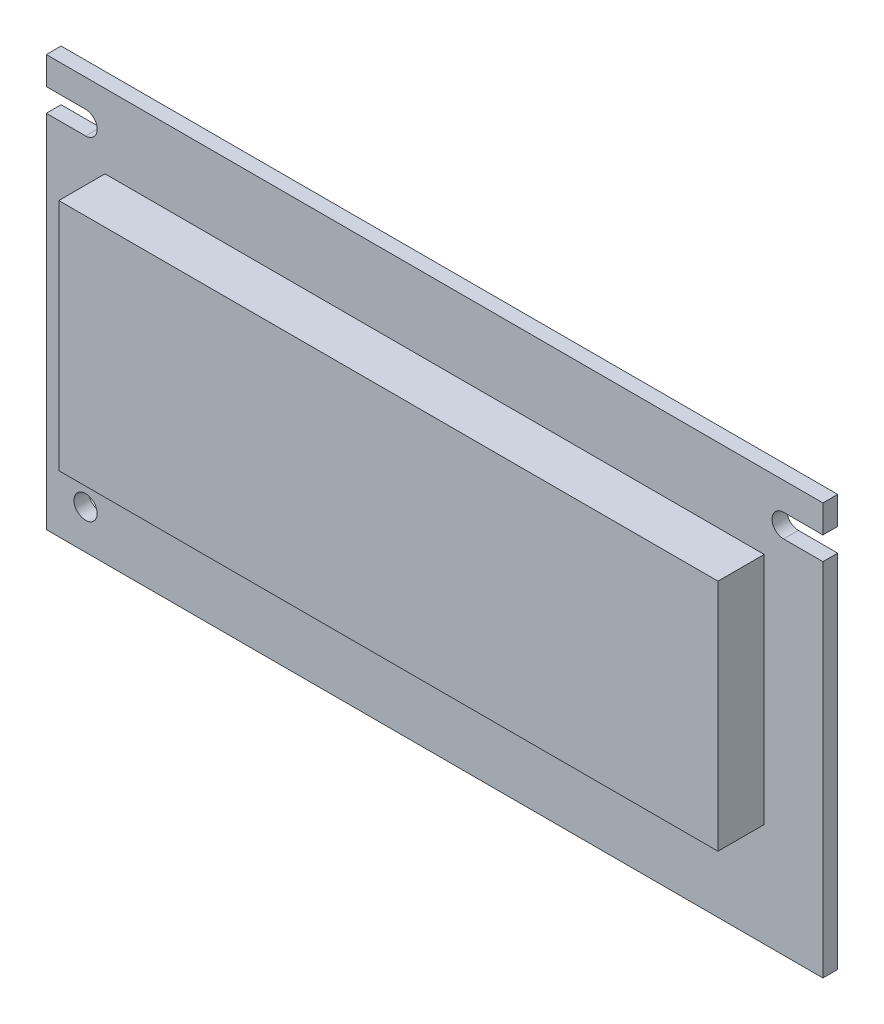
ISO-10303-21;
HEADER;
FILE_DESCRIPTION(('STEP AP214'),'2;1');
FILE_NAME('part.step','',(''),(''),'','','');
FILE_SCHEMA(('AUTOMOTIVE_DESIGN { 1 0 10303 214 1 1 1 1 }'));
ENDSEC;
DATA;
#1=APPLICATION_CONTEXT('core data for automotive mechanical design processes');
#2=APPLICATION_PROTOCOL_DEFINITION('international standard','automotive_design',2000,#1);
#3=PRODUCT_CONTEXT('',#1,'mechanical');
#4=PRODUCT('Part','Part','',(#3));
#5=PRODUCT_RELATED_PRODUCT_CATEGORY('part','',(#4));
#6=PRODUCT_DEFINITION_FORMATION('','',#4);
#7=PRODUCT_DEFINITION_CONTEXT('part definition',#1,'design');
#8=PRODUCT_DEFINITION('design','',#6,#7);
#9=PRODUCT_DEFINITION_SHAPE('','',#8);
#10=(LENGTH_UNIT() NAMED_UNIT(*) SI_UNIT(.MILLI.,.METRE.));
#11=(NAMED_UNIT(*) PLANE_ANGLE_UNIT() SI_UNIT($,.RADIAN.));
#12=(NAMED_UNIT(*) SI_UNIT($,.STERADIAN.) SOLID_ANGLE_UNIT());
#13=UNCERTAINTY_MEASURE_WITH_UNIT(LENGTH_MEASURE(1.E-05),#10,'distance_accuracy_value','');
#14=(GEOMETRIC_REPRESENTATION_CONTEXT(3) GLOBAL_UNCERTAINTY_ASSIGNED_CONTEXT((#13)) GLOBAL_UNIT_ASSIGNED_CONTEXT((#10,
#11,#12)) REPRESENTATION_CONTEXT('',''));
#15=CARTESIAN_POINT('',(0.,0.,0.));
#16=DIRECTION('',(0.,0.,1.));
#17=DIRECTION('',(1.,0.,0.));
#18=AXIS2_PLACEMENT_3D('',#15,#16,#17);
#19=CARTESIAN_POINT('',(0.,0.,1.6));
#20=DIRECTION('',(1.,0.,0.));
#21=DIRECTION('',(0.,0.,-1.));
#22=AXIS2_PLACEMENT_3D('',#19,#20,#21);
#23=PLANE('',#22);
#24=DIRECTION('',(0.,-1.,0.));
#25=VECTOR('',#24,1.);
#26=CARTESIAN_POINT('',(0.,0.,1.6));
#27=LINE('',#26,#25);
#28=CARTESIAN_POINT('',(0.,39.,1.6));
#29=VERTEX_POINT('',#28);
#30=CARTESIAN_POINT('',(0.,0.,1.6));
#31=VERTEX_POINT('',#30);
#32=EDGE_CURVE('E267',#29,#31,#27,.T.);
#33=ORIENTED_EDGE('',*,*,#32,.F.);
#34=DIRECTION('',(0.,0.,1.));
#35=VECTOR('',#34,1.);
#36=CARTESIAN_POINT('',(0.,39.,-12.501025));
#37=LINE('',#36,#35);
#38=CARTESIAN_POINT('',(0.,39.,0.));
#39=VERTEX_POINT('',#38);
#40=EDGE_CURVE('E323',#39,#29,#37,.T.);
#41=ORIENTED_EDGE('',*,*,#40,.F.);
#42=DIRECTION('',(0.,-1.,0.));
#43=VECTOR('',#42,1.);
#44=CARTESIAN_POINT('',(0.,0.,0.));
#45=LINE('',#44,#43);
#46=CARTESIAN_POINT('',(0.,0.,0.));
#47=VERTEX_POINT('',#46);
#48=EDGE_CURVE('E264',#39,#47,#45,.T.);
#49=ORIENTED_EDGE('',*,*,#48,.T.);
#50=DIRECTION('',(0.,0.,-1.));
#51=VECTOR('',#50,1.);
#52=CARTESIAN_POINT('',(0.,0.,1.6));
#53=LINE('',#52,#51);
#54=EDGE_CURVE('E11',#31,#47,#53,.T.);
#55=ORIENTED_EDGE('',*,*,#54,.F.);
#56=EDGE_LOOP('',(#33,#41,#49,#55));
#57=FACE_BOUND('',#56,.T.);
#58=ADVANCED_FACE('F34',(#57),#23,.F.);
#59=CARTESIAN_POINT('',(4.25,40.25,-0.000999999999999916));
#60=DIRECTION('',(0.,0.,1.));
#61=DIRECTION('',(1.,0.,0.));
#62=AXIS2_PLACEMENT_3D('',#59,#60,#61);
#63=CYLINDRICAL_SURFACE('',#62,1.25);
#64=DIRECTION('',(0.,0.,1.));
#65=VECTOR('',#64,1.);
#66=CARTESIAN_POINT('',(4.25,39.,-0.000999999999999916));
#67=LINE('',#66,#65);
#68=CARTESIAN_POINT('',(4.25,39.,0.));
#69=VERTEX_POINT('',#68);
#70=CARTESIAN_POINT('',(4.25,39.,1.6));
#71=VERTEX_POINT('',#70);
#72=EDGE_CURVE('E204',#69,#71,#67,.T.);
#73=ORIENTED_EDGE('',*,*,#72,.T.);
#74=CARTESIAN_POINT('',(4.25,40.25,1.6));
#75=DIRECTION('',(0.,0.,1.));
#76=DIRECTION('',(1.,0.,0.));
#77=AXIS2_PLACEMENT_3D('',#74,#75,#76);
#78=CIRCLE('',#77,1.25);
#79=CARTESIAN_POINT('',(4.25,41.5,1.6));
#80=VERTEX_POINT('',#79);
#81=EDGE_CURVE('E211',#71,#80,#78,.T.);
#82=ORIENTED_EDGE('',*,*,#81,.T.);
#83=DIRECTION('',(0.,0.,1.));
#84=VECTOR('',#83,1.);
#85=CARTESIAN_POINT('',(4.25,41.5,-0.000999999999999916));
#86=LINE('',#85,#84);
#87=CARTESIAN_POINT('',(4.25,41.5,0.));
#88=VERTEX_POINT('',#87);
#89=EDGE_CURVE('E195',#88,#80,#86,.T.);
#90=ORIENTED_EDGE('',*,*,#89,.F.);
#91=CARTESIAN_POINT('',(4.25,40.25,0.));
#92=DIRECTION('',(0.,0.,-1.));
#93=DIRECTION('',(-1.,0.,0.));
#94=AXIS2_PLACEMENT_3D('',#91,#92,#93);
#95=CIRCLE('',#94,1.25);
#96=EDGE_CURVE('E218',#69,#88,#95,.F.);
#97=ORIENTED_EDGE('',*,*,#96,.F.);
#98=EDGE_LOOP('',(#73,#82,#90,#97));
#99=FACE_BOUND('',#98,.T.);
#100=ADVANCED_FACE('F216',(#99),#63,.F.);
#101=CARTESIAN_POINT('',(84.,0.,1.6));
#102=DIRECTION('',(-1.,0.,0.));
#103=DIRECTION('',(0.,0.,1.));
#104=AXIS2_PLACEMENT_3D('',#101,#102,#103);
#105=PLANE('',#104);
#106=DIRECTION('',(0.,1.,0.));
#107=VECTOR('',#106,1.);
#108=CARTESIAN_POINT('',(84.,0.,1.6));
#109=LINE('',#108,#107);
#110=CARTESIAN_POINT('',(84.,41.5,1.6));
#111=VERTEX_POINT('',#110);
#112=CARTESIAN_POINT('',(84.,44.5,1.6));
#113=VERTEX_POINT('',#112);
#114=EDGE_CURVE('E269',#111,#113,#109,.T.);
#115=ORIENTED_EDGE('',*,*,#114,.F.);
#116=DIRECTION('',(0.,0.,1.));
#117=VECTOR('',#116,1.);
#118=CARTESIAN_POINT('',(84.,41.5,-12.501025));
#119=LINE('',#118,#117);
#120=CARTESIAN_POINT('',(84.,41.5,0.));
#121=VERTEX_POINT('',#120);
#122=EDGE_CURVE('E313',#121,#111,#119,.T.);
#123=ORIENTED_EDGE('',*,*,#122,.F.);
#124=DIRECTION('',(0.,1.,0.));
#125=VECTOR('',#124,1.);
#126=CARTESIAN_POINT('',(84.,0.,0.));
#127=LINE('',#126,#125);
#128=CARTESIAN_POINT('',(84.,44.5,0.));
#129=VERTEX_POINT('',#128);
#130=EDGE_CURVE('E290',#121,#129,#127,.T.);
#131=ORIENTED_EDGE('',*,*,#130,.T.);
#132=DIRECTION('',(0.,0.,-1.));
#133=VECTOR('',#132,1.);
#134=CARTESIAN_POINT('',(84.,44.5,1.6));
#135=LINE('',#134,#133);
#136=EDGE_CURVE('E294',#113,#129,#135,.T.);
#137=ORIENTED_EDGE('',*,*,#136,.F.);
#138=EDGE_LOOP('',(#115,#123,#131,#137));
#139=FACE_BOUND('',#138,.T.);
#140=ADVANCED_FACE('F311',(#139),#105,.F.);
#141=CARTESIAN_POINT('',(79.75,40.25,-0.000999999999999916));
#142=DIRECTION('',(0.,0.,1.));
#143=DIRECTION('',(1.,0.,0.));
#144=AXIS2_PLACEMENT_3D('',#141,#142,#143);
#145=CYLINDRICAL_SURFACE('',#144,1.25);
#146=DIRECTION('',(0.,0.,1.));
#147=VECTOR('',#146,1.);
#148=CARTESIAN_POINT('',(79.75,41.5,-0.000999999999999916));
#149=LINE('',#148,#147);
#150=CARTESIAN_POINT('',(79.75,41.5,0.));
#151=VERTEX_POINT('',#150);
#152=CARTESIAN_POINT('',(79.75,41.5,1.6));
#153=VERTEX_POINT('',#152);
#154=EDGE_CURVE('E331',#151,#153,#149,.T.);
#155=ORIENTED_EDGE('',*,*,#154,.T.);
#156=CARTESIAN_POINT('',(79.75,40.25,1.6));
#157=DIRECTION('',(0.,0.,1.));
#158=DIRECTION('',(1.,0.,0.));
#159=AXIS2_PLACEMENT_3D('',#156,#157,#158);
#160=CIRCLE('',#159,1.25);
#161=CARTESIAN_POINT('',(79.75,39.,1.6));
#162=VERTEX_POINT('',#161);
#163=EDGE_CURVE('E221',#153,#162,#160,.T.);
#164=ORIENTED_EDGE('',*,*,#163,.T.);
#165=DIRECTION('',(0.,0.,1.));
#166=VECTOR('',#165,1.);
#167=CARTESIAN_POINT('',(79.75,39.,-0.000999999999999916));
#168=LINE('',#167,#166);
#169=CARTESIAN_POINT('',(79.75,39.,0.));
#170=VERTEX_POINT('',#169);
#171=EDGE_CURVE('E329',#170,#162,#168,.T.);
#172=ORIENTED_EDGE('',*,*,#171,.F.);
#173=CARTESIAN_POINT('',(79.75,40.25,0.));
#174=DIRECTION('',(0.,0.,-1.));
#175=DIRECTION('',(-1.,0.,0.));
#176=AXIS2_PLACEMENT_3D('',#173,#174,#175);
#177=CIRCLE('',#176,1.25);
#178=EDGE_CURVE('E217',#151,#170,#177,.F.);
#179=ORIENTED_EDGE('',*,*,#178,.F.);
#180=EDGE_LOOP('',(#155,#164,#172,#179));
#181=FACE_BOUND('',#180,.T.);
#182=ADVANCED_FACE('F451',(#181),#145,.F.);
#183=CARTESIAN_POINT('',(8.,20.,-12.5));
#184=DIRECTION('',(1.,0.,0.));
#185=DIRECTION('',(0.,1.,0.));
#186=AXIS2_PLACEMENT_3D('',#183,#184,#185);
#187=PLANE('',#186);
#188=DIRECTION('',(0.,1.,0.));
#189=VECTOR('',#188,1.);
#190=CARTESIAN_POINT('',(8.,20.,0.));
#191=LINE('',#190,#189);
#192=CARTESIAN_POINT('',(8.,0.,0.));
#193=VERTEX_POINT('',#192);
#194=CARTESIAN_POINT('',(8.,20.,0.));
#195=VERTEX_POINT('',#194);
#196=EDGE_CURVE('E393',#193,#195,#191,.T.);
#197=ORIENTED_EDGE('',*,*,#196,.T.);
#198=DIRECTION('',(0.,0.,1.));
#199=VECTOR('',#198,1.);
#200=CARTESIAN_POINT('',(8.,20.,-12.5));
#201=LINE('',#200,#199);
#202=CARTESIAN_POINT('',(8.,20.,-12.5));
#203=VERTEX_POINT('',#202);
#204=EDGE_CURVE('E396',#203,#195,#201,.T.);
#205=ORIENTED_EDGE('',*,*,#204,.F.);
#206=DIRECTION('',(0.,1.,0.));
#207=VECTOR('',#206,1.);
#208=CARTESIAN_POINT('',(8.,20.,-12.5));
#209=LINE('',#208,#207);
#210=CARTESIAN_POINT('',(8.00000000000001,0.,-12.5));
#211=VERTEX_POINT('',#210);
#212=EDGE_CURVE('E385',#211,#203,#209,.T.);
#213=ORIENTED_EDGE('',*,*,#212,.F.);
#214=DIRECTION('',(0.,0.,1.));
#215=VECTOR('',#214,1.);
#216=CARTESIAN_POINT('',(8.00000000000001,0.,-12.5));
#217=LINE('',#216,#215);
#218=EDGE_CURVE('E398',#211,#193,#217,.T.);
#219=ORIENTED_EDGE('',*,*,#218,.T.);
#220=EDGE_LOOP('',(#197,#205,#213,#219));
#221=FACE_BOUND('',#220,.T.);
#222=DIRECTION('',(0.,-1.,0.));
#223=VECTOR('',#222,1.);
#224=CARTESIAN_POINT('',(8.,15.5367831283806,-7.5));
#225=LINE('',#224,#223);
#226=CARTESIAN_POINT('',(8.,15.5367831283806,-7.5));
#227=VERTEX_POINT('',#226);
#228=CARTESIAN_POINT('',(8.,7.53678312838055,-7.5));
#229=VERTEX_POINT('',#228);
#230=EDGE_CURVE('E346',#227,#229,#225,.T.);
#231=ORIENTED_EDGE('',*,*,#230,.F.);
#232=DIRECTION('',(0.,0.,-1.));
#233=VECTOR('',#232,1.);
#234=CARTESIAN_POINT('',(8.,15.5367831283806,-7.5));
#235=LINE('',#234,#233);
#236=CARTESIAN_POINT('',(8.,15.5367831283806,-5.5));
#237=VERTEX_POINT('',#236);
#238=EDGE_CURVE('E351',#237,#227,#235,.T.);
#239=ORIENTED_EDGE('',*,*,#238,.F.);
#240=DIRECTION('',(0.,1.,0.));
#241=VECTOR('',#240,1.);
#242=CARTESIAN_POINT('',(8.,15.5367831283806,-5.5));
#243=LINE('',#242,#241);
#244=CARTESIAN_POINT('',(8.,7.53678312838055,-5.5));
#245=VERTEX_POINT('',#244);
#246=EDGE_CURVE('E363',#245,#237,#243,.T.);
#247=ORIENTED_EDGE('',*,*,#246,.F.);
#248=DIRECTION('',(0.,0.,1.));
#249=VECTOR('',#248,1.);
#250=CARTESIAN_POINT('',(8.,7.53678312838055,-7.5));
#251=LINE('',#250,#249);
#252=EDGE_CURVE('E360',#229,#245,#251,.T.);
#253=ORIENTED_EDGE('',*,*,#252,.F.);
#254=EDGE_LOOP('',(#231,#239,#247,#253));
#255=FACE_BOUND('',#254,.T.);
#256=ADVANCED_FACE('F428',(#221,#255),#187,.F.);
#257=CARTESIAN_POINT('',(0.,44.5,1.6));
#258=DIRECTION('',(0.,0.,-1.));
#259=DIRECTION('',(-1.,0.,0.));
#260=AXIS2_PLACEMENT_3D('',#257,#258,#259);
#261=PLANE('',#260);
#262=CARTESIAN_POINT('',(4.25,4.25,1.6));
#263=DIRECTION('',(0.,0.,1.));
#264=DIRECTION('',(1.,0.,0.));
#265=AXIS2_PLACEMENT_3D('',#262,#263,#264);
#266=CIRCLE('',#265,1.25);
#267=CARTESIAN_POINT('',(5.5,4.25,1.6));
#268=VERTEX_POINT('',#267);
#269=EDGE_CURVE('E223',#268,#268,#266,.T.);
#270=ORIENTED_EDGE('',*,*,#269,.F.);
#271=EDGE_LOOP('',(#270));
#272=FACE_BOUND('',#271,.T.);
#273=ORIENTED_EDGE('',*,*,#81,.F.);
#274=DIRECTION('',(1.,0.,0.));
#275=VECTOR('',#274,1.);
#276=CARTESIAN_POINT('',(4.25,39.,1.6));
#277=LINE('',#276,#275);
#278=EDGE_CURVE('E52',#29,#71,#277,.T.);
#279=ORIENTED_EDGE('',*,*,#278,.F.);
#280=ORIENTED_EDGE('',*,*,#32,.T.);
#281=DIRECTION('',(1.,0.,0.));
#282=VECTOR('',#281,1.);
#283=CARTESIAN_POINT('',(0.,0.,1.6));
#284=LINE('',#283,#282);
#285=CARTESIAN_POINT('',(84.,0.,1.6));
#286=VERTEX_POINT('',#285);
#287=EDGE_CURVE('E266',#31,#286,#284,.T.);
#288=ORIENTED_EDGE('',*,*,#287,.T.);
#289=CARTESIAN_POINT('',(84.,39.,1.6));
#290=VERTEX_POINT('',#289);
#291=EDGE_CURVE('E270',#286,#290,#109,.T.);
#292=ORIENTED_EDGE('',*,*,#291,.T.);
#293=DIRECTION('',(1.,0.,0.));
#294=VECTOR('',#293,1.);
#295=CARTESIAN_POINT('',(79.75,39.,1.6));
#296=LINE('',#295,#294);
#297=EDGE_CURVE('E336',#162,#290,#296,.T.);
#298=ORIENTED_EDGE('',*,*,#297,.F.);
#299=ORIENTED_EDGE('',*,*,#163,.F.);
#300=DIRECTION('',(-1.,0.,0.));
#301=VECTOR('',#300,1.);
#302=CARTESIAN_POINT('',(79.75,41.5,1.6));
#303=LINE('',#302,#301);
#304=EDGE_CURVE('E338',#111,#153,#303,.T.);
#305=ORIENTED_EDGE('',*,*,#304,.F.);
#306=ORIENTED_EDGE('',*,*,#114,.T.);
#307=DIRECTION('',(-1.,0.,0.));
#308=VECTOR('',#307,1.);
#309=CARTESIAN_POINT('',(0.,44.5,1.6));
#310=LINE('',#309,#308);
#311=CARTESIAN_POINT('',(0.,44.5,1.6));
#312=VERTEX_POINT('',#311);
#313=EDGE_CURVE('E273',#113,#312,#310,.T.);
#314=ORIENTED_EDGE('',*,*,#313,.T.);
#315=CARTESIAN_POINT('',(0.,41.5,1.6));
#316=VERTEX_POINT('',#315);
#317=EDGE_CURVE('E213',#312,#316,#27,.T.);
#318=ORIENTED_EDGE('',*,*,#317,.T.);
#319=DIRECTION('',(-1.,0.,0.));
#320=VECTOR('',#319,1.);
#321=CARTESIAN_POINT('',(4.25,41.5,1.6));
#322=LINE('',#321,#320);
#323=EDGE_CURVE('E198',#80,#316,#322,.T.);
#324=ORIENTED_EDGE('',*,*,#323,.F.);
#325=EDGE_LOOP('',(#273,#279,#280,#288,#292,#298,#299,#305,#306,#314,#318,#324));
#326=FACE_BOUND('',#325,.T.);
#327=DIRECTION('',(0.,-1.,0.));
#328=VECTOR('',#327,1.);
#329=CARTESIAN_POINT('',(6.35,36.5,1.6));
#330=LINE('',#329,#328);
#331=CARTESIAN_POINT('',(6.35,36.5,1.6));
#332=VERTEX_POINT('',#331);
#333=CARTESIAN_POINT('',(6.35,11.2,1.6));
#334=VERTEX_POINT('',#333);
#335=EDGE_CURVE('E230',#332,#334,#330,.T.);
#336=ORIENTED_EDGE('',*,*,#335,.F.);
#337=DIRECTION('',(-1.,0.,0.));
#338=VECTOR('',#337,1.);
#339=CARTESIAN_POINT('',(6.35,36.5,1.6));
#340=LINE('',#339,#338);
#341=CARTESIAN_POINT('',(77.65,36.5,1.6));
#342=VERTEX_POINT('',#341);
#343=EDGE_CURVE('E236',#342,#332,#340,.T.);
#344=ORIENTED_EDGE('',*,*,#343,.F.);
#345=DIRECTION('',(0.,1.,0.));
#346=VECTOR('',#345,1.);
#347=CARTESIAN_POINT('',(77.65,36.5,1.6));
#348=LINE('',#347,#346);
#349=CARTESIAN_POINT('',(77.65,11.2,1.6));
#350=VERTEX_POINT('',#349);
#351=EDGE_CURVE('E248',#350,#342,#348,.T.);
#352=ORIENTED_EDGE('',*,*,#351,.F.);
#353=DIRECTION('',(1.,0.,0.));
#354=VECTOR('',#353,1.);
#355=CARTESIAN_POINT('',(6.35,11.2,1.6));
#356=LINE('',#355,#354);
#357=EDGE_CURVE('E245',#334,#350,#356,.T.);
#358=ORIENTED_EDGE('',*,*,#357,.F.);
#359=EDGE_LOOP('',(#336,#344,#352,#358));
#360=FACE_BOUND('',#359,.T.);
#361=ADVANCED_FACE('F209',(#272,#326,#360),#261,.F.);
#362=CARTESIAN_POINT('',(0.,44.5,0.));
#363=VERTEX_POINT('',#362);
#364=CARTESIAN_POINT('',(0.,41.5,0.));
#365=VERTEX_POINT('',#364);
#366=EDGE_CURVE('E276',#363,#365,#45,.T.);
#367=ORIENTED_EDGE('',*,*,#366,.T.);
#368=DIRECTION('',(0.,0.,1.));
#369=VECTOR('',#368,1.);
#370=CARTESIAN_POINT('',(0.,41.5,-12.501025));
#371=LINE('',#370,#369);
#372=EDGE_CURVE('E322',#365,#316,#371,.T.);
#373=ORIENTED_EDGE('',*,*,#372,.T.);
#374=ORIENTED_EDGE('',*,*,#317,.F.);
#375=DIRECTION('',(0.,0.,-1.));
#376=VECTOR('',#375,1.);
#377=CARTESIAN_POINT('',(0.,44.5,1.6));
#378=LINE('',#377,#376);
#379=EDGE_CURVE('E275',#312,#363,#378,.T.);
#380=ORIENTED_EDGE('',*,*,#379,.T.);
#381=EDGE_LOOP('',(#367,#373,#374,#380));
#382=FACE_BOUND('',#381,.T.);
#383=ADVANCED_FACE('F36',(#382),#23,.F.);
#384=CARTESIAN_POINT('',(0.,0.,1.6));
#385=DIRECTION('',(0.,1.,0.));
#386=DIRECTION('',(0.,0.,1.));
#387=AXIS2_PLACEMENT_3D('',#384,#385,#386);
#388=PLANE('',#387);
#389=DIRECTION('',(1.,0.,0.));
#390=VECTOR('',#389,1.);
#391=CARTESIAN_POINT('',(0.,0.,0.));
#392=LINE('',#391,#390);
#393=EDGE_CURVE('E288',#47,#193,#392,.T.);
#394=ORIENTED_EDGE('',*,*,#393,.T.);
#395=ORIENTED_EDGE('',*,*,#218,.F.);
#396=DIRECTION('',(-1.,0.,0.));
#397=VECTOR('',#396,1.);
#398=CARTESIAN_POINT('',(67.,0.,-12.5));
#399=LINE('',#398,#397);
#400=CARTESIAN_POINT('',(67.,0.,-12.5));
#401=VERTEX_POINT('',#400);
#402=EDGE_CURVE('E382',#401,#211,#399,.T.);
#403=ORIENTED_EDGE('',*,*,#402,.F.);
#404=DIRECTION('',(0.,0.,1.));
#405=VECTOR('',#404,1.);
#406=CARTESIAN_POINT('',(67.,0.,-12.5));
#407=LINE('',#406,#405);
#408=CARTESIAN_POINT('',(66.9999999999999,0.,0.));
#409=VERTEX_POINT('',#408);
#410=EDGE_CURVE('E403',#401,#409,#407,.T.);
#411=ORIENTED_EDGE('',*,*,#410,.T.);
#412=CARTESIAN_POINT('',(84.,0.,0.));
#413=VERTEX_POINT('',#412);
#414=EDGE_CURVE('E279',#409,#413,#392,.T.);
#415=ORIENTED_EDGE('',*,*,#414,.T.);
#416=DIRECTION('',(0.,0.,-1.));
#417=VECTOR('',#416,1.);
#418=CARTESIAN_POINT('',(84.,0.,1.6));
#419=LINE('',#418,#417);
#420=EDGE_CURVE('E44',#286,#413,#419,.T.);
#421=ORIENTED_EDGE('',*,*,#420,.F.);
#422=ORIENTED_EDGE('',*,*,#287,.F.);
#423=ORIENTED_EDGE('',*,*,#54,.T.);
#424=EDGE_LOOP('',(#394,#395,#403,#411,#415,#421,#422,#423));
#425=FACE_BOUND('',#424,.T.);
#426=ADVANCED_FACE('F433',(#425),#388,.F.);
#427=CARTESIAN_POINT('',(84.,39.,0.));
#428=VERTEX_POINT('',#427);
#429=EDGE_CURVE('E282',#413,#428,#127,.T.);
#430=ORIENTED_EDGE('',*,*,#429,.T.);
#431=DIRECTION('',(0.,0.,1.));
#432=VECTOR('',#431,1.);
#433=CARTESIAN_POINT('',(84.,39.,-12.501025));
#434=LINE('',#433,#432);
#435=EDGE_CURVE('E340',#428,#290,#434,.T.);
#436=ORIENTED_EDGE('',*,*,#435,.T.);
#437=ORIENTED_EDGE('',*,*,#291,.F.);
#438=ORIENTED_EDGE('',*,*,#420,.T.);
#439=EDGE_LOOP('',(#430,#436,#437,#438));
#440=FACE_BOUND('',#439,.T.);
#441=ADVANCED_FACE('F444',(#440),#105,.F.);
#442=CARTESIAN_POINT('',(0.,44.5,1.6));
#443=DIRECTION('',(0.,-1.,0.));
#444=DIRECTION('',(0.,0.,-1.));
#445=AXIS2_PLACEMENT_3D('',#442,#443,#444);
#446=PLANE('',#445);
#447=DIRECTION('',(-1.,0.,0.));
#448=VECTOR('',#447,1.);
#449=CARTESIAN_POINT('',(0.,44.5,0.));
#450=LINE('',#449,#448);
#451=EDGE_CURVE('E298',#129,#363,#450,.T.);
#452=ORIENTED_EDGE('',*,*,#451,.T.);
#453=ORIENTED_EDGE('',*,*,#379,.F.);
#454=ORIENTED_EDGE('',*,*,#313,.F.);
#455=ORIENTED_EDGE('',*,*,#136,.T.);
#456=EDGE_LOOP('',(#452,#453,#454,#455));
#457=FACE_BOUND('',#456,.T.);
#458=ADVANCED_FACE('F316',(#457),#446,.F.);
#459=CARTESIAN_POINT('',(0.,44.5,0.));
#460=DIRECTION('',(0.,0.,-1.));
#461=DIRECTION('',(-1.,0.,0.));
#462=AXIS2_PLACEMENT_3D('',#459,#460,#461);
#463=PLANE('',#462);
#464=DIRECTION('',(1.,0.,0.));
#465=VECTOR('',#464,1.);
#466=CARTESIAN_POINT('',(4.25,39.,0.));
#467=LINE('',#466,#465);
#468=EDGE_CURVE('E214',#39,#69,#467,.T.);
#469=ORIENTED_EDGE('',*,*,#468,.T.);
#470=ORIENTED_EDGE('',*,*,#96,.T.);
#471=DIRECTION('',(-1.,0.,0.));
#472=VECTOR('',#471,1.);
#473=CARTESIAN_POINT('',(4.25,41.5,0.));
#474=LINE('',#473,#472);
#475=EDGE_CURVE('E60',#88,#365,#474,.T.);
#476=ORIENTED_EDGE('',*,*,#475,.T.);
#477=ORIENTED_EDGE('',*,*,#366,.F.);
#478=ORIENTED_EDGE('',*,*,#451,.F.);
#479=ORIENTED_EDGE('',*,*,#130,.F.);
#480=DIRECTION('',(-1.,0.,0.));
#481=VECTOR('',#480,1.);
#482=CARTESIAN_POINT('',(79.75,41.5,0.));
#483=LINE('',#482,#481);
#484=EDGE_CURVE('E334',#121,#151,#483,.T.);
#485=ORIENTED_EDGE('',*,*,#484,.T.);
#486=ORIENTED_EDGE('',*,*,#178,.T.);
#487=DIRECTION('',(1.,0.,0.));
#488=VECTOR('',#487,1.);
#489=CARTESIAN_POINT('',(79.75,39.,0.));
#490=LINE('',#489,#488);
#491=EDGE_CURVE('E342',#170,#428,#490,.T.);
#492=ORIENTED_EDGE('',*,*,#491,.T.);
#493=ORIENTED_EDGE('',*,*,#429,.F.);
#494=ORIENTED_EDGE('',*,*,#414,.F.);
#495=DIRECTION('',(0.,-1.,0.));
#496=VECTOR('',#495,1.);
#497=CARTESIAN_POINT('',(67.,20.,0.));
#498=LINE('',#497,#496);
#499=CARTESIAN_POINT('',(67.,20.,0.));
#500=VERTEX_POINT('',#499);
#501=EDGE_CURVE('E38',#500,#409,#498,.T.);
#502=ORIENTED_EDGE('',*,*,#501,.F.);
#503=DIRECTION('',(1.,0.,0.));
#504=VECTOR('',#503,1.);
#505=CARTESIAN_POINT('',(67.,20.,0.));
#506=LINE('',#505,#504);
#507=EDGE_CURVE('E383',#195,#500,#506,.T.);
#508=ORIENTED_EDGE('',*,*,#507,.F.);
#509=ORIENTED_EDGE('',*,*,#196,.F.);
#510=ORIENTED_EDGE('',*,*,#393,.F.);
#511=ORIENTED_EDGE('',*,*,#48,.F.);
#512=EDGE_LOOP('',(#469,#470,#476,#477,#478,#479,#485,#486,#492,#493,#494,#502,#508,#509,#510,#511));
#513=FACE_BOUND('',#512,.T.);
#514=CARTESIAN_POINT('',(4.25,4.25,0.));
#515=DIRECTION('',(0.,0.,-1.));
#516=DIRECTION('',(-1.,0.,0.));
#517=AXIS2_PLACEMENT_3D('',#514,#515,#516);
#518=CIRCLE('',#517,1.25);
#519=CARTESIAN_POINT('',(3.,4.25,0.));
#520=VERTEX_POINT('',#519);
#521=EDGE_CURVE('E226',#520,#520,#518,.F.);
#522=ORIENTED_EDGE('',*,*,#521,.T.);
#523=EDGE_LOOP('',(#522));
#524=FACE_BOUND('',#523,.T.);
#525=ADVANCED_FACE('F319',(#513,#524),#463,.T.);
#526=CARTESIAN_POINT('',(6.35,36.5,6.6));
#527=DIRECTION('',(1.,0.,0.));
#528=DIRECTION('',(0.,1.,0.));
#529=AXIS2_PLACEMENT_3D('',#526,#527,#528);
#530=PLANE('',#529);
#531=ORIENTED_EDGE('',*,*,#335,.T.);
#532=DIRECTION('',(0.,0.,-1.));
#533=VECTOR('',#532,1.);
#534=CARTESIAN_POINT('',(6.35,11.2,6.6));
#535=LINE('',#534,#533);
#536=CARTESIAN_POINT('',(6.35,11.2,6.6));
#537=VERTEX_POINT('',#536);
#538=EDGE_CURVE('E261',#537,#334,#535,.T.);
#539=ORIENTED_EDGE('',*,*,#538,.F.);
#540=DIRECTION('',(0.,-1.,0.));
#541=VECTOR('',#540,1.);
#542=CARTESIAN_POINT('',(6.35,36.5,6.6));
#543=LINE('',#542,#541);
#544=CARTESIAN_POINT('',(6.35,36.5,6.6));
#545=VERTEX_POINT('',#544);
#546=EDGE_CURVE('E232',#545,#537,#543,.T.);
#547=ORIENTED_EDGE('',*,*,#546,.F.);
#548=DIRECTION('',(0.,0.,-1.));
#549=VECTOR('',#548,1.);
#550=CARTESIAN_POINT('',(6.35,36.5,6.6));
#551=LINE('',#550,#549);
#552=EDGE_CURVE('E242',#545,#332,#551,.T.);
#553=ORIENTED_EDGE('',*,*,#552,.T.);
#554=EDGE_LOOP('',(#531,#539,#547,#553));
#555=FACE_BOUND('',#554,.T.);
#556=ADVANCED_FACE('F485',(#555),#530,.F.);
#557=CARTESIAN_POINT('',(6.35,11.2,6.6));
#558=DIRECTION('',(0.,1.,0.));
#559=DIRECTION('',(0.,0.,1.));
#560=AXIS2_PLACEMENT_3D('',#557,#558,#559);
#561=PLANE('',#560);
#562=ORIENTED_EDGE('',*,*,#357,.T.);
#563=DIRECTION('',(0.,0.,-1.));
#564=VECTOR('',#563,1.);
#565=CARTESIAN_POINT('',(77.65,11.2,6.6));
#566=LINE('',#565,#564);
#567=CARTESIAN_POINT('',(77.65,11.2,6.6));
#568=VERTEX_POINT('',#567);
#569=EDGE_CURVE('E258',#568,#350,#566,.T.);
#570=ORIENTED_EDGE('',*,*,#569,.F.);
#571=DIRECTION('',(1.,0.,0.));
#572=VECTOR('',#571,1.);
#573=CARTESIAN_POINT('',(6.35,11.2,6.6));
#574=LINE('',#573,#572);
#575=EDGE_CURVE('E235',#537,#568,#574,.T.);
#576=ORIENTED_EDGE('',*,*,#575,.F.);
#577=ORIENTED_EDGE('',*,*,#538,.T.);
#578=EDGE_LOOP('',(#562,#570,#576,#577));
#579=FACE_BOUND('',#578,.T.);
#580=ADVANCED_FACE('F514',(#579),#561,.F.);
#581=CARTESIAN_POINT('',(77.65,36.5,6.6));
#582=DIRECTION('',(-1.,0.,0.));
#583=DIRECTION('',(0.,0.,1.));
#584=AXIS2_PLACEMENT_3D('',#581,#582,#583);
#585=PLANE('',#584);
#586=ORIENTED_EDGE('',*,*,#351,.T.);
#587=DIRECTION('',(0.,0.,-1.));
#588=VECTOR('',#587,1.);
#589=CARTESIAN_POINT('',(77.65,36.5,6.6));
#590=LINE('',#589,#588);
#591=CARTESIAN_POINT('',(77.65,36.5,6.6));
#592=VERTEX_POINT('',#591);
#593=EDGE_CURVE('E255',#592,#342,#590,.T.);
#594=ORIENTED_EDGE('',*,*,#593,.F.);
#595=DIRECTION('',(0.,1.,0.));
#596=VECTOR('',#595,1.);
#597=CARTESIAN_POINT('',(77.65,36.5,6.6));
#598=LINE('',#597,#596);
#599=EDGE_CURVE('E238',#568,#592,#598,.T.);
#600=ORIENTED_EDGE('',*,*,#599,.F.);
#601=ORIENTED_EDGE('',*,*,#569,.T.);
#602=EDGE_LOOP('',(#586,#594,#600,#601));
#603=FACE_BOUND('',#602,.T.);
#604=ADVANCED_FACE('F511',(#603),#585,.F.);
#605=CARTESIAN_POINT('',(6.35,36.5,6.6));
#606=DIRECTION('',(0.,-1.,0.));
#607=DIRECTION('',(1.,0.,0.));
#608=AXIS2_PLACEMENT_3D('',#605,#606,#607);
#609=PLANE('',#608);
#610=ORIENTED_EDGE('',*,*,#343,.T.);
#611=ORIENTED_EDGE('',*,*,#552,.F.);
#612=DIRECTION('',(-1.,0.,0.));
#613=VECTOR('',#612,1.);
#614=CARTESIAN_POINT('',(6.35,36.5,6.6));
#615=LINE('',#614,#613);
#616=EDGE_CURVE('E240',#592,#545,#615,.T.);
#617=ORIENTED_EDGE('',*,*,#616,.F.);
#618=ORIENTED_EDGE('',*,*,#593,.T.);
#619=EDGE_LOOP('',(#610,#611,#617,#618));
#620=FACE_BOUND('',#619,.T.);
#621=ADVANCED_FACE('F507',(#620),#609,.F.);
#622=CARTESIAN_POINT('',(6.35,11.2,6.6));
#623=DIRECTION('',(0.,0.,1.));
#624=DIRECTION('',(1.,0.,0.));
#625=AXIS2_PLACEMENT_3D('',#622,#623,#624);
#626=PLANE('',#625);
#627=ORIENTED_EDGE('',*,*,#546,.T.);
#628=ORIENTED_EDGE('',*,*,#575,.T.);
#629=ORIENTED_EDGE('',*,*,#599,.T.);
#630=ORIENTED_EDGE('',*,*,#616,.T.);
#631=EDGE_LOOP('',(#627,#628,#629,#630));
#632=FACE_BOUND('',#631,.T.);
#633=ADVANCED_FACE('F503',(#632),#626,.T.);
#634=CARTESIAN_POINT('',(4.25,4.25,-0.000999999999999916));
#635=DIRECTION('',(0.,0.,1.));
#636=DIRECTION('',(1.,0.,0.));
#637=AXIS2_PLACEMENT_3D('',#634,#635,#636);
#638=CYLINDRICAL_SURFACE('',#637,1.25);
#639=ORIENTED_EDGE('',*,*,#521,.F.);
#640=EDGE_LOOP('',(#639));
#641=FACE_BOUND('',#640,.T.);
#642=ORIENTED_EDGE('',*,*,#269,.T.);
#643=EDGE_LOOP('',(#642));
#644=FACE_BOUND('',#643,.T.);
#645=ADVANCED_FACE('F506',(#641,#644),#638,.F.);
#646=CARTESIAN_POINT('',(67.,20.,-12.5));
#647=DIRECTION('',(-1.,0.,0.));
#648=DIRECTION('',(0.,0.,1.));
#649=AXIS2_PLACEMENT_3D('',#646,#647,#648);
#650=PLANE('',#649);
#651=ORIENTED_EDGE('',*,*,#501,.T.);
#652=ORIENTED_EDGE('',*,*,#410,.F.);
#653=DIRECTION('',(0.,-1.,0.));
#654=VECTOR('',#653,1.);
#655=CARTESIAN_POINT('',(67.,20.,-12.5));
#656=LINE('',#655,#654);
#657=CARTESIAN_POINT('',(67.,20.,-12.5));
#658=VERTEX_POINT('',#657);
#659=EDGE_CURVE('E379',#658,#401,#656,.T.);
#660=ORIENTED_EDGE('',*,*,#659,.F.);
#661=DIRECTION('',(0.,0.,1.));
#662=VECTOR('',#661,1.);
#663=CARTESIAN_POINT('',(67.,20.,-12.5));
#664=LINE('',#663,#662);
#665=EDGE_CURVE('E388',#658,#500,#664,.T.);
#666=ORIENTED_EDGE('',*,*,#665,.T.);
#667=EDGE_LOOP('',(#651,#652,#660,#666));
#668=FACE_BOUND('',#667,.T.);
#669=ADVANCED_FACE('F421',(#668),#650,.F.);
#670=CARTESIAN_POINT('',(67.,20.,-12.5));
#671=DIRECTION('',(0.,-1.,0.));
#672=DIRECTION('',(1.,0.,0.));
#673=AXIS2_PLACEMENT_3D('',#670,#671,#672);
#674=PLANE('',#673);
#675=ORIENTED_EDGE('',*,*,#507,.T.);
#676=ORIENTED_EDGE('',*,*,#665,.F.);
#677=DIRECTION('',(1.,0.,0.));
#678=VECTOR('',#677,1.);
#679=CARTESIAN_POINT('',(67.,20.,-12.5));
#680=LINE('',#679,#678);
#681=EDGE_CURVE('E387',#203,#658,#680,.T.);
#682=ORIENTED_EDGE('',*,*,#681,.F.);
#683=ORIENTED_EDGE('',*,*,#204,.T.);
#684=EDGE_LOOP('',(#675,#676,#682,#683));
#685=FACE_BOUND('',#684,.T.);
#686=ADVANCED_FACE('F425',(#685),#674,.F.);
#687=CARTESIAN_POINT('',(67.,0.,-12.5));
#688=DIRECTION('',(0.,0.,-1.));
#689=DIRECTION('',(-1.,0.,0.));
#690=AXIS2_PLACEMENT_3D('',#687,#688,#689);
#691=PLANE('',#690);
#692=ORIENTED_EDGE('',*,*,#659,.T.);
#693=ORIENTED_EDGE('',*,*,#402,.T.);
#694=ORIENTED_EDGE('',*,*,#212,.T.);
#695=ORIENTED_EDGE('',*,*,#681,.T.);
#696=EDGE_LOOP('',(#692,#693,#694,#695));
#697=FACE_BOUND('',#696,.T.);
#698=ADVANCED_FACE('F432',(#697),#691,.T.);
#699=CARTESIAN_POINT('',(2.,15.5367831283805,-7.5));
#700=DIRECTION('',(0.,0.,1.));
#701=DIRECTION('',(0.,-1.,0.));
#702=AXIS2_PLACEMENT_3D('',#699,#700,#701);
#703=PLANE('',#702);
#704=ORIENTED_EDGE('',*,*,#230,.T.);
#705=DIRECTION('',(1.,0.,0.));
#706=VECTOR('',#705,1.);
#707=CARTESIAN_POINT('',(2.,7.53678312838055,-7.5));
#708=LINE('',#707,#706);
#709=CARTESIAN_POINT('',(2.,7.53678312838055,-7.5));
#710=VERTEX_POINT('',#709);
#711=EDGE_CURVE('E376',#710,#229,#708,.T.);
#712=ORIENTED_EDGE('',*,*,#711,.F.);
#713=DIRECTION('',(0.,-1.,0.));
#714=VECTOR('',#713,1.);
#715=CARTESIAN_POINT('',(2.,15.5367831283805,-7.5));
#716=LINE('',#715,#714);
#717=CARTESIAN_POINT('',(2.,15.5367831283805,-7.5));
#718=VERTEX_POINT('',#717);
#719=EDGE_CURVE('E347',#718,#710,#716,.T.);
#720=ORIENTED_EDGE('',*,*,#719,.F.);
#721=DIRECTION('',(1.,0.,0.));
#722=VECTOR('',#721,1.);
#723=CARTESIAN_POINT('',(2.,15.5367831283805,-7.5));
#724=LINE('',#723,#722);
#725=EDGE_CURVE('E357',#718,#227,#724,.T.);
#726=ORIENTED_EDGE('',*,*,#725,.T.);
#727=EDGE_LOOP('',(#704,#712,#720,#726));
#728=FACE_BOUND('',#727,.T.);
#729=ADVANCED_FACE('F609',(#728),#703,.F.);
#730=CARTESIAN_POINT('',(2.,7.53678312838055,-7.5));
#731=DIRECTION('',(0.,1.,0.));
#732=DIRECTION('',(-1.,0.,0.));
#733=AXIS2_PLACEMENT_3D('',#730,#731,#732);
#734=PLANE('',#733);
#735=ORIENTED_EDGE('',*,*,#252,.T.);
#736=DIRECTION('',(1.,0.,0.));
#737=VECTOR('',#736,1.);
#738=CARTESIAN_POINT('',(2.,7.53678312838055,-5.5));
#739=LINE('',#738,#737);
#740=CARTESIAN_POINT('',(2.,7.53678312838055,-5.5));
#741=VERTEX_POINT('',#740);
#742=EDGE_CURVE('E373',#741,#245,#739,.T.);
#743=ORIENTED_EDGE('',*,*,#742,.F.);
#744=DIRECTION('',(0.,0.,1.));
#745=VECTOR('',#744,1.);
#746=CARTESIAN_POINT('',(2.,7.53678312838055,-7.5));
#747=LINE('',#746,#745);
#748=EDGE_CURVE('E350',#710,#741,#747,.T.);
#749=ORIENTED_EDGE('',*,*,#748,.F.);
#750=ORIENTED_EDGE('',*,*,#711,.T.);
#751=EDGE_LOOP('',(#735,#743,#749,#750));
#752=FACE_BOUND('',#751,.T.);
#753=ADVANCED_FACE('F622',(#752),#734,.F.);
#754=CARTESIAN_POINT('',(2.,15.5367831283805,-5.5));
#755=DIRECTION('',(0.,0.,-1.));
#756=DIRECTION('',(0.,1.,0.));
#757=AXIS2_PLACEMENT_3D('',#754,#755,#756);
#758=PLANE('',#757);
#759=ORIENTED_EDGE('',*,*,#246,.T.);
#760=DIRECTION('',(1.,0.,0.));
#761=VECTOR('',#760,1.);
#762=CARTESIAN_POINT('',(2.,15.5367831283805,-5.5));
#763=LINE('',#762,#761);
#764=CARTESIAN_POINT('',(2.,15.5367831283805,-5.5));
#765=VERTEX_POINT('',#764);
#766=EDGE_CURVE('E370',#765,#237,#763,.T.);
#767=ORIENTED_EDGE('',*,*,#766,.F.);
#768=DIRECTION('',(0.,1.,0.));
#769=VECTOR('',#768,1.);
#770=CARTESIAN_POINT('',(2.,15.5367831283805,-5.5));
#771=LINE('',#770,#769);
#772=EDGE_CURVE('E353',#741,#765,#771,.T.);
#773=ORIENTED_EDGE('',*,*,#772,.F.);
#774=ORIENTED_EDGE('',*,*,#742,.T.);
#775=EDGE_LOOP('',(#759,#767,#773,#774));
#776=FACE_BOUND('',#775,.T.);
#777=ADVANCED_FACE('F631',(#776),#758,.F.);
#778=CARTESIAN_POINT('',(2.,15.5367831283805,-7.5));
#779=DIRECTION('',(0.,-1.,0.));
#780=DIRECTION('',(1.,0.,0.));
#781=AXIS2_PLACEMENT_3D('',#778,#779,#780);
#782=PLANE('',#781);
#783=ORIENTED_EDGE('',*,*,#238,.T.);
#784=ORIENTED_EDGE('',*,*,#725,.F.);
#785=DIRECTION('',(0.,0.,-1.));
#786=VECTOR('',#785,1.);
#787=CARTESIAN_POINT('',(2.,15.5367831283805,-7.5));
#788=LINE('',#787,#786);
#789=EDGE_CURVE('E355',#765,#718,#788,.T.);
#790=ORIENTED_EDGE('',*,*,#789,.F.);
#791=ORIENTED_EDGE('',*,*,#766,.T.);
#792=EDGE_LOOP('',(#783,#784,#790,#791));
#793=FACE_BOUND('',#792,.T.);
#794=ADVANCED_FACE('F464',(#793),#782,.F.);
#795=CARTESIAN_POINT('',(2.,7.53678312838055,-7.5));
#796=DIRECTION('',(-1.,0.,0.));
#797=DIRECTION('',(0.,-1.,0.));
#798=AXIS2_PLACEMENT_3D('',#795,#796,#797);
#799=PLANE('',#798);
#800=ORIENTED_EDGE('',*,*,#719,.T.);
#801=ORIENTED_EDGE('',*,*,#748,.T.);
#802=ORIENTED_EDGE('',*,*,#772,.T.);
#803=ORIENTED_EDGE('',*,*,#789,.T.);
#804=EDGE_LOOP('',(#800,#801,#802,#803));
#805=FACE_BOUND('',#804,.T.);
#806=ADVANCED_FACE('F457',(#805),#799,.T.);
#807=CARTESIAN_POINT('',(79.75,39.,-12.501025));
#808=DIRECTION('',(0.,-1.,0.));
#809=DIRECTION('',(0.,0.,-1.));
#810=AXIS2_PLACEMENT_3D('',#807,#808,#809);
#811=PLANE('',#810);
#812=ORIENTED_EDGE('',*,*,#171,.T.);
#813=ORIENTED_EDGE('',*,*,#297,.T.);
#814=ORIENTED_EDGE('',*,*,#435,.F.);
#815=ORIENTED_EDGE('',*,*,#491,.F.);
#816=EDGE_LOOP('',(#812,#813,#814,#815));
#817=FACE_BOUND('',#816,.T.);
#818=ADVANCED_FACE('F455',(#817),#811,.F.);
#819=CARTESIAN_POINT('',(79.75,41.5,-12.501025));
#820=DIRECTION('',(0.,1.,0.));
#821=DIRECTION('',(0.,0.,1.));
#822=AXIS2_PLACEMENT_3D('',#819,#820,#821);
#823=PLANE('',#822);
#824=ORIENTED_EDGE('',*,*,#122,.T.);
#825=ORIENTED_EDGE('',*,*,#304,.T.);
#826=ORIENTED_EDGE('',*,*,#154,.F.);
#827=ORIENTED_EDGE('',*,*,#484,.F.);
#828=EDGE_LOOP('',(#824,#825,#826,#827));
#829=FACE_BOUND('',#828,.T.);
#830=ADVANCED_FACE('F454',(#829),#823,.F.);
#831=CARTESIAN_POINT('',(4.25,41.5,-12.501025));
#832=DIRECTION('',(0.,1.,0.));
#833=DIRECTION('',(0.,0.,1.));
#834=AXIS2_PLACEMENT_3D('',#831,#832,#833);
#835=PLANE('',#834);
#836=ORIENTED_EDGE('',*,*,#89,.T.);
#837=ORIENTED_EDGE('',*,*,#323,.T.);
#838=ORIENTED_EDGE('',*,*,#372,.F.);
#839=ORIENTED_EDGE('',*,*,#475,.F.);
#840=EDGE_LOOP('',(#836,#837,#838,#839));
#841=FACE_BOUND('',#840,.T.);
#842=ADVANCED_FACE('F197',(#841),#835,.F.);
#843=CARTESIAN_POINT('',(4.25,39.,-12.501025));
#844=DIRECTION('',(0.,-1.,0.));
#845=DIRECTION('',(0.,0.,-1.));
#846=AXIS2_PLACEMENT_3D('',#843,#844,#845);
#847=PLANE('',#846);
#848=ORIENTED_EDGE('',*,*,#40,.T.);
#849=ORIENTED_EDGE('',*,*,#278,.T.);
#850=ORIENTED_EDGE('',*,*,#72,.F.);
#851=ORIENTED_EDGE('',*,*,#468,.F.);
#852=EDGE_LOOP('',(#848,#849,#850,#851));
#853=FACE_BOUND('',#852,.T.);
#854=ADVANCED_FACE('F441',(#853),#847,.F.);
#855=CLOSED_SHELL('',(#58,#100,#140,#182,#256,#361,#383,#426,#441,#458,#525,#556,#580,#604,#621,
#633,#645,#669,#686,#698,#729,#753,#777,#794,#806,#818,#830,#842,#854));
#856=MANIFOLD_SOLID_BREP('B2',#855);
#857=ADVANCED_BREP_SHAPE_REPRESENTATION('',(#18,#856),#14);
#858=SHAPE_DEFINITION_REPRESENTATION(#9,#857);
ENDSEC;
END-ISO-10303-21;
